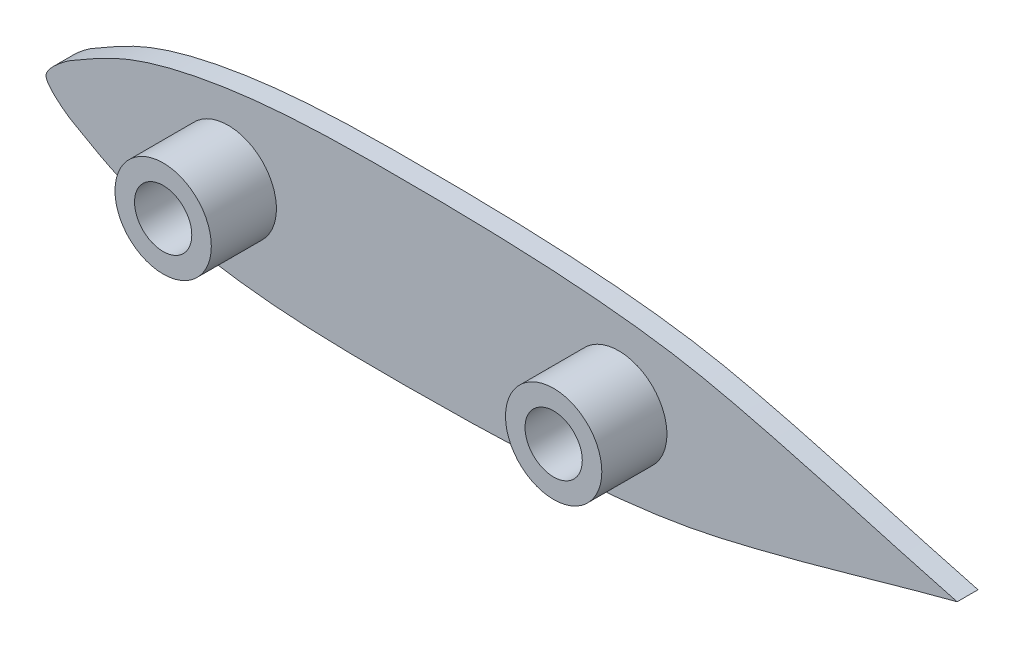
from build123d import *

# Parameters (mm, degrees)
BOSS_EXTRUDE1_DEPTH = 0.8
SKETCH4_R           = 1.1
CUT_EXTRUDE3_DEPTH  = 23
SKETCH5_R           = 1.85
BOSS_EXTRUDE2_DEPTH = 2.5
SKETCH4_2_R         = 1.1
CUT_EXTRUDE4_DEPTH  = 20


with BuildPart() as part:
    # Sketch1 → Boss-Extrude1 (new body)
    with BuildSketch(Plane.XY):
        with BuildLine():
            add(Edge.make_bspline(
                [(0, 0), (0.007727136, 0.267032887), (0.797245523, 0.898720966), (1.409957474, 1.236149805), (3.069985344, 2.259200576), (7.565425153, 3.331084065), (13.362385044, 3.482891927), (22.290039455, 3.265274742), (29.293829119, 1.652129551), (32.234609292, 0.717869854), (35, 0)],
                knots=[0, 0, 0, 0, 0.022524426, 0.034643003, 0.121185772, 0.243771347, 0.472972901, 0.711145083, 0.763847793, 1, 1, 1, 1], degree=3))
            add(Edge.make_bspline(
                [(0, 0), (0.007727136, -0.267032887), (0.797245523, -0.898720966), (1.409957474, -1.236149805), (3.069985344, -2.259200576), (7.565425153, -3.331084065), (13.362385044, -3.482891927), (22.290039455, -3.265274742), (29.293829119, -1.652129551), (32.234609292, -0.717869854), (35, 0)],
                knots=[0, 0, 0, 0, 0.022524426, 0.034643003, 0.121185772, 0.243771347, 0.472972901, 0.711145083, 0.763847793, 1, 1, 1, 1], degree=3))
        make_face()
    extrude(amount=BOSS_EXTRUDE1_DEPTH)

    # Sketch4 → Cut-Extrude3 (cut)
    with BuildSketch(Plane.XY.offset(15)):
        with Locations(Location((7, 0, 0), (0, 0, 180))):
            Circle(SKETCH4_R)
        with Locations(Location((22, 0, 0), (0, 0, 180))):
            Circle(SKETCH4_R)
    extrude(amount=-CUT_EXTRUDE3_DEPTH, mode=Mode.SUBTRACT)

    # Sketch5 → Boss-Extrude2 (add)
    with BuildSketch(Plane.XY.offset(0.8)):
        with Locations(Location((7, 0, 0), (0, 0, 180))):
            Circle(SKETCH5_R)
        with Locations(Location((22, 0, 0), (0, 0, 180))):
            Circle(SKETCH5_R)
    extrude(amount=BOSS_EXTRUDE2_DEPTH)

    # Sketch4_2 → Cut-Extrude4 (cut)
    with BuildSketch(Plane.XY.offset(15)):
        with Locations((7, 0)):
            Circle(SKETCH4_2_R)
        with Locations((22, 0)):
            Circle(SKETCH4_2_R)
    extrude(amount=-CUT_EXTRUDE4_DEPTH, mode=Mode.SUBTRACT)


solid = part.part
